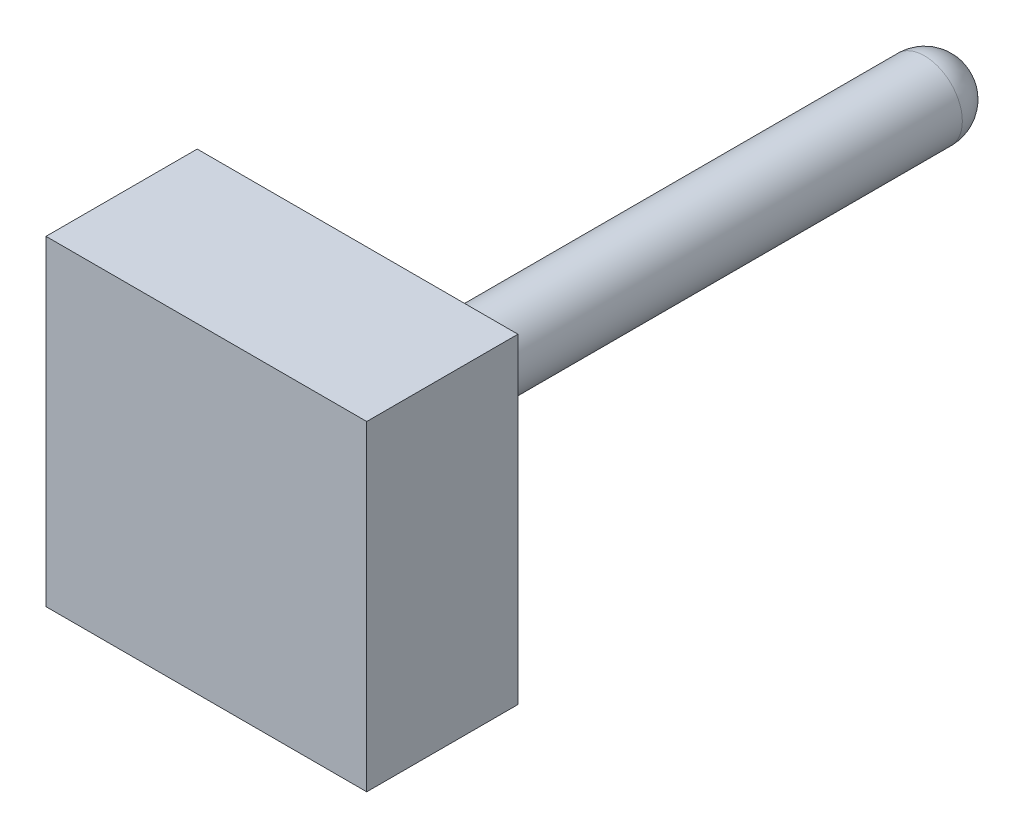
ISO-10303-21;
HEADER;
FILE_DESCRIPTION(('STEP AP214'),'2;1');
FILE_NAME('part.step','',(''),(''),'','','');
FILE_SCHEMA(('AUTOMOTIVE_DESIGN { 1 0 10303 214 1 1 1 1 }'));
ENDSEC;
DATA;
#1=APPLICATION_CONTEXT('core data for automotive mechanical design processes');
#2=APPLICATION_PROTOCOL_DEFINITION('international standard','automotive_design',2000,#1);
#3=PRODUCT_CONTEXT('',#1,'mechanical');
#4=PRODUCT('Part','Part','',(#3));
#5=PRODUCT_RELATED_PRODUCT_CATEGORY('part','',(#4));
#6=PRODUCT_DEFINITION_FORMATION('','',#4);
#7=PRODUCT_DEFINITION_CONTEXT('part definition',#1,'design');
#8=PRODUCT_DEFINITION('design','',#6,#7);
#9=PRODUCT_DEFINITION_SHAPE('','',#8);
#10=(LENGTH_UNIT() NAMED_UNIT(*) SI_UNIT(.MILLI.,.METRE.));
#11=(NAMED_UNIT(*) PLANE_ANGLE_UNIT() SI_UNIT($,.RADIAN.));
#12=(NAMED_UNIT(*) SI_UNIT($,.STERADIAN.) SOLID_ANGLE_UNIT());
#13=UNCERTAINTY_MEASURE_WITH_UNIT(LENGTH_MEASURE(1.E-05),#10,'distance_accuracy_value','');
#14=(GEOMETRIC_REPRESENTATION_CONTEXT(3) GLOBAL_UNCERTAINTY_ASSIGNED_CONTEXT((#13)) GLOBAL_UNIT_ASSIGNED_CONTEXT((#10,
#11,#12)) REPRESENTATION_CONTEXT('',''));
#15=CARTESIAN_POINT('',(0.,0.,0.));
#16=DIRECTION('',(0.,0.,1.));
#17=DIRECTION('',(1.,0.,0.));
#18=AXIS2_PLACEMENT_3D('',#15,#16,#17);
#19=CARTESIAN_POINT('',(0.,0.,6.35));
#20=DIRECTION('',(0.,0.,-1.));
#21=DIRECTION('',(-1.,0.,0.));
#22=AXIS2_PLACEMENT_3D('',#19,#20,#21);
#23=CYLINDRICAL_SURFACE('',#22,0.396875);
#24=CARTESIAN_POINT('',(0.,0.,0.396875));
#25=DIRECTION('',(0.,0.,-1.));
#26=DIRECTION('',(-1.,0.,0.));
#27=AXIS2_PLACEMENT_3D('',#24,#25,#26);
#28=CIRCLE('',#27,0.396875);
#29=CARTESIAN_POINT('',(-0.396875,0.,0.396875));
#30=VERTEX_POINT('',#29);
#31=EDGE_CURVE('E11',#30,#30,#28,.F.);
#32=ORIENTED_EDGE('',*,*,#31,.T.);
#33=EDGE_LOOP('',(#32));
#34=FACE_BOUND('',#33,.T.);
#35=CARTESIAN_POINT('',(0.,0.,6.35));
#36=DIRECTION('',(0.,0.,1.));
#37=DIRECTION('',(1.,0.,0.));
#38=AXIS2_PLACEMENT_3D('',#35,#36,#37);
#39=CIRCLE('',#38,0.396875);
#40=CARTESIAN_POINT('',(0.396875,0.,6.35));
#41=VERTEX_POINT('',#40);
#42=EDGE_CURVE('E40',#41,#41,#39,.T.);
#43=ORIENTED_EDGE('',*,*,#42,.F.);
#44=EDGE_LOOP('',(#43));
#45=FACE_BOUND('',#44,.T.);
#46=ADVANCED_FACE('F31',(#34,#45),#23,.T.);
#47=CARTESIAN_POINT('',(1.68379802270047,1.68379802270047,6.35));
#48=DIRECTION('',(0.,0.,-1.));
#49=DIRECTION('',(-1.,0.,0.));
#50=AXIS2_PLACEMENT_3D('',#47,#48,#49);
#51=PLANE('',#50);
#52=DIRECTION('',(0.,1.,0.));
#53=VECTOR('',#52,1.);
#54=CARTESIAN_POINT('',(1.68379802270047,-1.68379802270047,6.35));
#55=LINE('',#54,#53);
#56=CARTESIAN_POINT('',(1.68379802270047,-1.68379802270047,6.35));
#57=VERTEX_POINT('',#56);
#58=CARTESIAN_POINT('',(1.68379802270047,1.68379802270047,6.35));
#59=VERTEX_POINT('',#58);
#60=EDGE_CURVE('E99',#57,#59,#55,.T.);
#61=ORIENTED_EDGE('',*,*,#60,.F.);
#62=DIRECTION('',(1.,0.,0.));
#63=VECTOR('',#62,1.);
#64=CARTESIAN_POINT('',(-1.68379802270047,-1.68379802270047,6.35));
#65=LINE('',#64,#63);
#66=CARTESIAN_POINT('',(-1.68379802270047,-1.68379802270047,6.35));
#67=VERTEX_POINT('',#66);
#68=EDGE_CURVE('E71',#67,#57,#65,.T.);
#69=ORIENTED_EDGE('',*,*,#68,.F.);
#70=DIRECTION('',(0.,-1.,0.));
#71=VECTOR('',#70,1.);
#72=CARTESIAN_POINT('',(-1.68379802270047,-1.68379802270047,6.35));
#73=LINE('',#72,#71);
#74=CARTESIAN_POINT('',(-1.68379802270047,1.68379802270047,6.35));
#75=VERTEX_POINT('',#74);
#76=EDGE_CURVE('E65',#75,#67,#73,.T.);
#77=ORIENTED_EDGE('',*,*,#76,.F.);
#78=DIRECTION('',(-1.,0.,0.));
#79=VECTOR('',#78,1.);
#80=CARTESIAN_POINT('',(-1.68379802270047,1.68379802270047,6.35));
#81=LINE('',#80,#79);
#82=EDGE_CURVE('E89',#59,#75,#81,.T.);
#83=ORIENTED_EDGE('',*,*,#82,.F.);
#84=EDGE_LOOP('',(#61,#69,#77,#83));
#85=FACE_BOUND('',#84,.T.);
#86=ORIENTED_EDGE('',*,*,#42,.T.);
#87=EDGE_LOOP('',(#86));
#88=FACE_BOUND('',#87,.T.);
#89=ADVANCED_FACE('F110',(#85,#88),#51,.T.);
#90=CARTESIAN_POINT('',(1.68379802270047,-1.68379802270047,7.9375));
#91=DIRECTION('',(-1.,0.,0.));
#92=DIRECTION('',(0.,0.,1.));
#93=AXIS2_PLACEMENT_3D('',#90,#91,#92);
#94=PLANE('',#93);
#95=ORIENTED_EDGE('',*,*,#60,.T.);
#96=DIRECTION('',(0.,0.,-1.));
#97=VECTOR('',#96,1.);
#98=CARTESIAN_POINT('',(1.68379802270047,1.68379802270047,7.9375));
#99=LINE('',#98,#97);
#100=CARTESIAN_POINT('',(1.68379802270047,1.68379802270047,7.9375));
#101=VERTEX_POINT('',#100);
#102=EDGE_CURVE('E90',#101,#59,#99,.T.);
#103=ORIENTED_EDGE('',*,*,#102,.F.);
#104=DIRECTION('',(0.,1.,0.));
#105=VECTOR('',#104,1.);
#106=CARTESIAN_POINT('',(1.68379802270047,-1.68379802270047,7.9375));
#107=LINE('',#106,#105);
#108=CARTESIAN_POINT('',(1.68379802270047,-1.68379802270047,7.9375));
#109=VERTEX_POINT('',#108);
#110=EDGE_CURVE('E84',#109,#101,#107,.T.);
#111=ORIENTED_EDGE('',*,*,#110,.F.);
#112=DIRECTION('',(0.,0.,-1.));
#113=VECTOR('',#112,1.);
#114=CARTESIAN_POINT('',(1.68379802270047,-1.68379802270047,7.9375));
#115=LINE('',#114,#113);
#116=EDGE_CURVE('E95',#109,#57,#115,.T.);
#117=ORIENTED_EDGE('',*,*,#116,.T.);
#118=EDGE_LOOP('',(#95,#103,#111,#117));
#119=FACE_BOUND('',#118,.T.);
#120=ADVANCED_FACE('F117',(#119),#94,.F.);
#121=CARTESIAN_POINT('',(-1.68379802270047,1.68379802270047,7.9375));
#122=DIRECTION('',(0.,-1.,0.));
#123=DIRECTION('',(0.,0.,-1.));
#124=AXIS2_PLACEMENT_3D('',#121,#122,#123);
#125=PLANE('',#124);
#126=ORIENTED_EDGE('',*,*,#82,.T.);
#127=DIRECTION('',(0.,0.,-1.));
#128=VECTOR('',#127,1.);
#129=CARTESIAN_POINT('',(-1.68379802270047,1.68379802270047,7.9375));
#130=LINE('',#129,#128);
#131=CARTESIAN_POINT('',(-1.68379802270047,1.68379802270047,7.9375));
#132=VERTEX_POINT('',#131);
#133=EDGE_CURVE('E87',#132,#75,#130,.T.);
#134=ORIENTED_EDGE('',*,*,#133,.F.);
#135=DIRECTION('',(-1.,0.,0.));
#136=VECTOR('',#135,1.);
#137=CARTESIAN_POINT('',(-1.68379802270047,1.68379802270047,7.9375));
#138=LINE('',#137,#136);
#139=EDGE_CURVE('E79',#101,#132,#138,.T.);
#140=ORIENTED_EDGE('',*,*,#139,.F.);
#141=ORIENTED_EDGE('',*,*,#102,.T.);
#142=EDGE_LOOP('',(#126,#134,#140,#141));
#143=FACE_BOUND('',#142,.T.);
#144=ADVANCED_FACE('F88',(#143),#125,.F.);
#145=CARTESIAN_POINT('',(-1.68379802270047,-1.68379802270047,7.9375));
#146=DIRECTION('',(1.,0.,0.));
#147=DIRECTION('',(0.,0.,-1.));
#148=AXIS2_PLACEMENT_3D('',#145,#146,#147);
#149=PLANE('',#148);
#150=ORIENTED_EDGE('',*,*,#76,.T.);
#151=DIRECTION('',(0.,0.,-1.));
#152=VECTOR('',#151,1.);
#153=CARTESIAN_POINT('',(-1.68379802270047,-1.68379802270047,7.9375));
#154=LINE('',#153,#152);
#155=CARTESIAN_POINT('',(-1.68379802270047,-1.68379802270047,7.9375));
#156=VERTEX_POINT('',#155);
#157=EDGE_CURVE('E91',#156,#67,#154,.T.);
#158=ORIENTED_EDGE('',*,*,#157,.F.);
#159=DIRECTION('',(0.,-1.,0.));
#160=VECTOR('',#159,1.);
#161=CARTESIAN_POINT('',(-1.68379802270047,-1.68379802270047,7.9375));
#162=LINE('',#161,#160);
#163=EDGE_CURVE('E82',#132,#156,#162,.T.);
#164=ORIENTED_EDGE('',*,*,#163,.F.);
#165=ORIENTED_EDGE('',*,*,#133,.T.);
#166=EDGE_LOOP('',(#150,#158,#164,#165));
#167=FACE_BOUND('',#166,.T.);
#168=ADVANCED_FACE('F93',(#167),#149,.F.);
#169=CARTESIAN_POINT('',(-1.68379802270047,-1.68379802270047,7.9375));
#170=DIRECTION('',(0.,1.,0.));
#171=DIRECTION('',(0.,0.,1.));
#172=AXIS2_PLACEMENT_3D('',#169,#170,#171);
#173=PLANE('',#172);
#174=ORIENTED_EDGE('',*,*,#68,.T.);
#175=ORIENTED_EDGE('',*,*,#116,.F.);
#176=DIRECTION('',(1.,0.,0.));
#177=VECTOR('',#176,1.);
#178=CARTESIAN_POINT('',(-1.68379802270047,-1.68379802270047,7.9375));
#179=LINE('',#178,#177);
#180=EDGE_CURVE('E48',#156,#109,#179,.T.);
#181=ORIENTED_EDGE('',*,*,#180,.F.);
#182=ORIENTED_EDGE('',*,*,#157,.T.);
#183=EDGE_LOOP('',(#174,#175,#181,#182));
#184=FACE_BOUND('',#183,.T.);
#185=ADVANCED_FACE('F128',(#184),#173,.F.);
#186=CARTESIAN_POINT('',(1.68379802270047,1.68379802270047,7.9375));
#187=DIRECTION('',(0.,0.,-1.));
#188=DIRECTION('',(-1.,0.,0.));
#189=AXIS2_PLACEMENT_3D('',#186,#187,#188);
#190=PLANE('',#189);
#191=ORIENTED_EDGE('',*,*,#110,.T.);
#192=ORIENTED_EDGE('',*,*,#139,.T.);
#193=ORIENTED_EDGE('',*,*,#163,.T.);
#194=ORIENTED_EDGE('',*,*,#180,.T.);
#195=EDGE_LOOP('',(#191,#192,#193,#194));
#196=FACE_BOUND('',#195,.T.);
#197=ADVANCED_FACE('F80',(#196),#190,.F.);
#198=CARTESIAN_POINT('',(0.,0.,0.396875));
#199=DIRECTION('',(0.,0.,1.));
#200=DIRECTION('',(1.,0.,0.));
#201=AXIS2_PLACEMENT_3D('',#198,#199,#200);
#202=SPHERICAL_SURFACE('',#201,0.396875);
#203=ORIENTED_EDGE('',*,*,#31,.F.);
#204=EDGE_LOOP('',(#203));
#205=FACE_BOUND('',#204,.T.);
#206=ADVANCED_FACE('F33',(#205),#202,.T.);
#207=CLOSED_SHELL('',(#46,#89,#120,#144,#168,#185,#197,#206));
#208=MANIFOLD_SOLID_BREP('B2',#207);
#209=ADVANCED_BREP_SHAPE_REPRESENTATION('',(#18,#208),#14);
#210=SHAPE_DEFINITION_REPRESENTATION(#9,#209);
ENDSEC;
END-ISO-10303-21;
